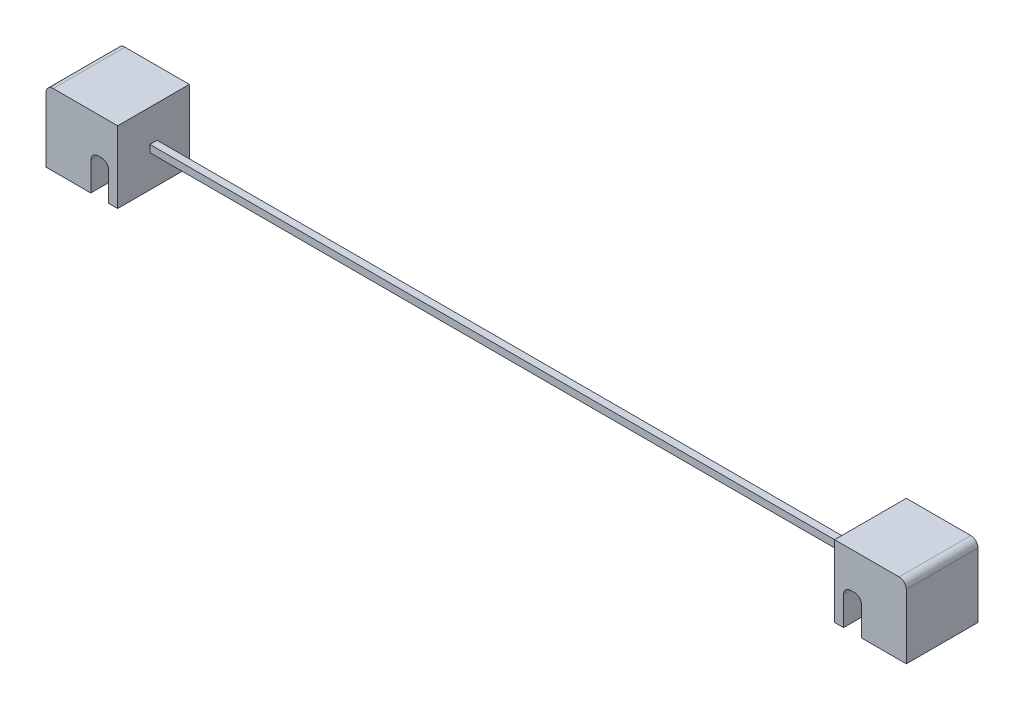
from build123d import *

# Parameters (mm, degrees)
BOSS_EXTRUDE2_DEPTH = 142.857142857
SKETCH3_W           = 14.285714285
SKETCH3_H           = 14.285714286
BOSS_EXTRUDE3_DEPTH = 1428.571428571


with BuildPart() as part:
    # Sketch2 → Boss-Extrude2 (new body)
    with BuildSketch(Plane.XY):
        with BuildLine():
            Line((-17.857142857, -71.428571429), (71.428571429, -71.428571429))
            Line((71.428571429, -71.428571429), (71.428571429, 57.142857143))
            ThreePointArc((71.428571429, 57.142857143), (67.244382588, 67.244382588), (57.142857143, 71.428571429))
            Line((57.142857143, 71.428571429), (-71.428571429, 71.428571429))
            Line((-71.428571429, 71.428571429), (-71.428571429, -71.428571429))
            Line((-71.428571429, -71.428571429), (-53.571428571, -71.428571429))
            Line((-53.571428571, -71.428571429), (-53.571428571, -14.285714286))
            ThreePointArc((-53.571428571, -14.285714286), (-49.387239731, -4.18418884), (-39.285714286, 0))
            Line((-39.285714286, 0), (-32.142857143, 0))
            ThreePointArc((-32.142857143, 0), (-22.041331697, -4.18418884), (-17.857142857, -14.285714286))
            Line((-17.857142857, -14.285714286), (-17.857142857, -71.428571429))
        make_face()
    boss_extrude2 = extrude(amount=BOSS_EXTRUDE2_DEPTH)

    # Sketch3 → Boss-Extrude3 (add)
    with BuildSketch(Plane.ZY.offset(71.428571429)):
        with Locations((71.428571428, 0)):
            Rectangle(SKETCH3_W, SKETCH3_H)
    extrude(amount=BOSS_EXTRUDE3_DEPTH)

    # Mirror1: Boss-Extrude2 across plane
    add(boss_extrude2.mirror(Plane.ZY.offset(785.714281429)))


solid = part.part
